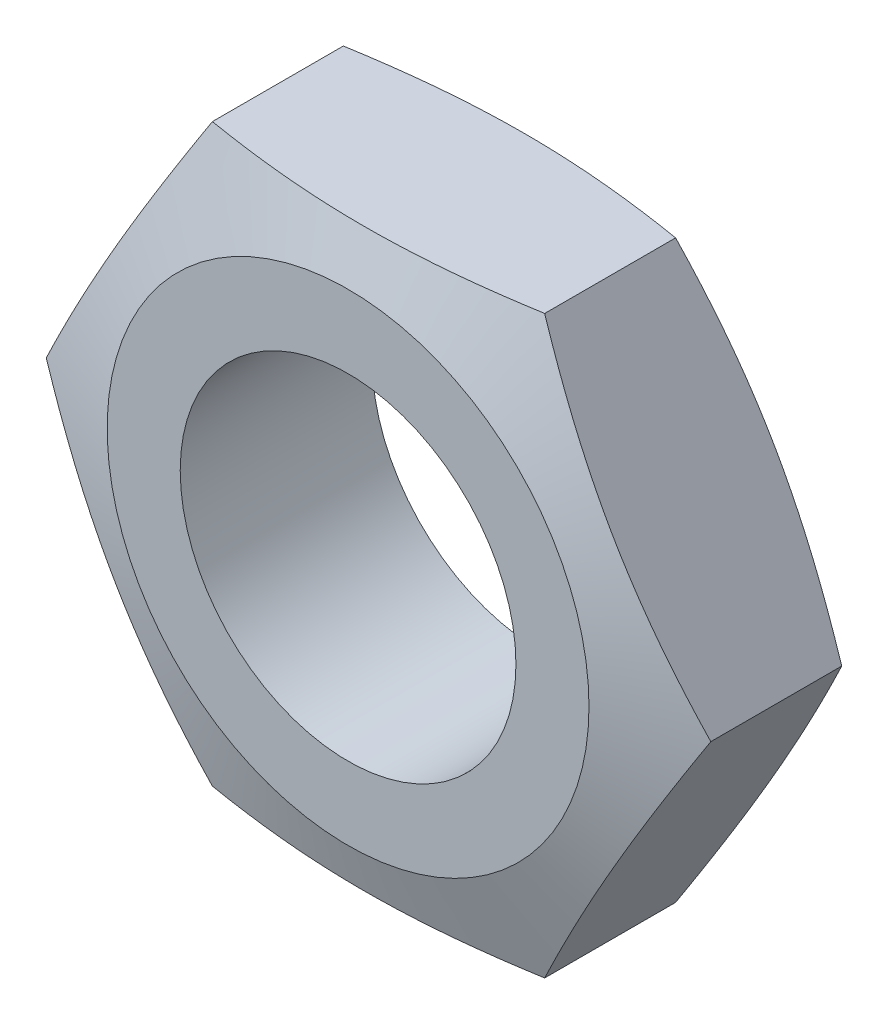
from build123d import *

# Parameters (mm, degrees)
SKETCH1_R           = 7
BOSS_EXTRUDE1_DEPTH = 4


with BuildPart() as part:
    # Sketch1 → Boss-Extrude1 (new, symmetric)
    with BuildSketch(Plane.XY):
        Polygon((-13.856406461, 0), (-6.92820323, -12), (6.92820323, -12), (13.856406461, 0), (6.92820323, 12), (-6.92820323, 12), align=None)
        Circle(SKETCH1_R, mode=Mode.SUBTRACT)
    extrude(amount=BOSS_EXTRUDE1_DEPTH, both=True)

    # Sketch2 → Cut-Revolve1 (revolve, cut)
    with BuildSketch(Plane(origin=(0, 0, 0), x_dir=(1, 0, 0), z_dir=(0, 1, 0))):
        Polygon((10.046406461, 4), (13.856406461, 2.73), (13.856406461, 4), align=None)
        Polygon((10.046406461, -4), (13.856406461, -2.73), (13.856406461, -4), align=None)
    revolve(axis=Axis((0, 0, 0), (0, 0, -1)), mode=Mode.SUBTRACT)


solid = part.part
